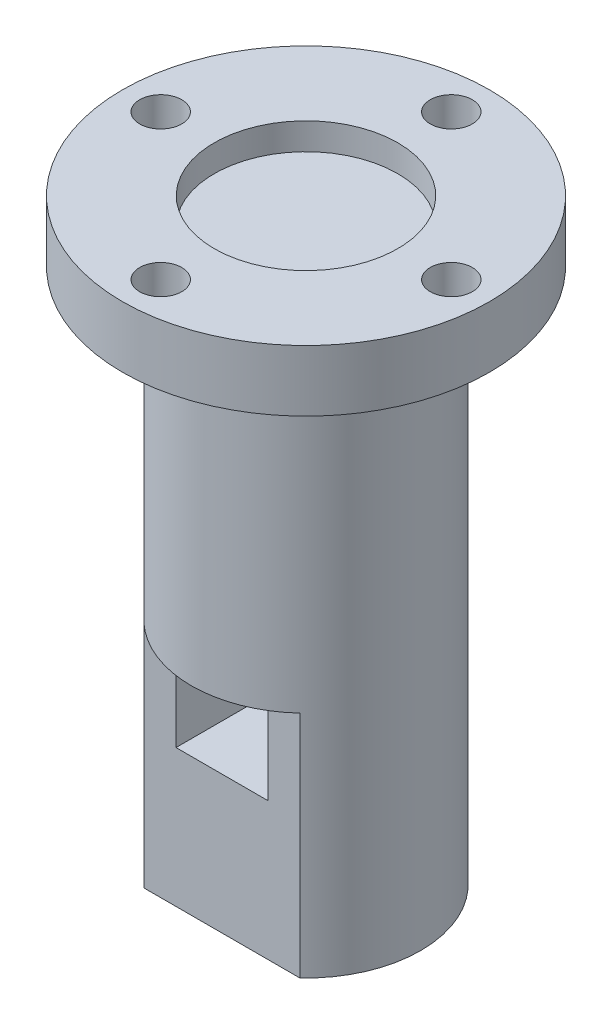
ISO-10303-21;
HEADER;
FILE_DESCRIPTION(('STEP AP214'),'2;1');
FILE_NAME('part.step','',(''),(''),'','','');
FILE_SCHEMA(('AUTOMOTIVE_DESIGN { 1 0 10303 214 1 1 1 1 }'));
ENDSEC;
DATA;
#1=APPLICATION_CONTEXT('core data for automotive mechanical design processes');
#2=APPLICATION_PROTOCOL_DEFINITION('international standard','automotive_design',2000,#1);
#3=PRODUCT_CONTEXT('',#1,'mechanical');
#4=PRODUCT('Part','Part','',(#3));
#5=PRODUCT_RELATED_PRODUCT_CATEGORY('part','',(#4));
#6=PRODUCT_DEFINITION_FORMATION('','',#4);
#7=PRODUCT_DEFINITION_CONTEXT('part definition',#1,'design');
#8=PRODUCT_DEFINITION('design','',#6,#7);
#9=PRODUCT_DEFINITION_SHAPE('','',#8);
#10=(LENGTH_UNIT() NAMED_UNIT(*) SI_UNIT(.MILLI.,.METRE.));
#11=(NAMED_UNIT(*) PLANE_ANGLE_UNIT() SI_UNIT($,.RADIAN.));
#12=(NAMED_UNIT(*) SI_UNIT($,.STERADIAN.) SOLID_ANGLE_UNIT());
#13=UNCERTAINTY_MEASURE_WITH_UNIT(LENGTH_MEASURE(1.E-05),#10,'distance_accuracy_value','');
#14=(GEOMETRIC_REPRESENTATION_CONTEXT(3) GLOBAL_UNCERTAINTY_ASSIGNED_CONTEXT((#13)) GLOBAL_UNIT_ASSIGNED_CONTEXT((#10,
#11,#12)) REPRESENTATION_CONTEXT('',''));
#15=CARTESIAN_POINT('',(0.,0.,0.));
#16=DIRECTION('',(0.,0.,1.));
#17=DIRECTION('',(1.,0.,0.));
#18=AXIS2_PLACEMENT_3D('',#15,#16,#17);
#19=CARTESIAN_POINT('',(0.,8.,0.));
#20=DIRECTION('',(0.,-1.,0.));
#21=DIRECTION('',(0.,0.,-1.));
#22=AXIS2_PLACEMENT_3D('',#19,#20,#21);
#23=CYLINDRICAL_SURFACE('',#22,24.);
#24=CARTESIAN_POINT('',(0.,8.,0.));
#25=DIRECTION('',(0.,1.,0.));
#26=DIRECTION('',(0.,0.,1.));
#27=AXIS2_PLACEMENT_3D('',#24,#25,#26);
#28=CIRCLE('',#27,24.);
#29=CARTESIAN_POINT('',(0.,8.,24.));
#30=VERTEX_POINT('',#29);
#31=EDGE_CURVE('E42',#30,#30,#28,.T.);
#32=ORIENTED_EDGE('',*,*,#31,.F.);
#33=EDGE_LOOP('',(#32));
#34=FACE_BOUND('',#33,.T.);
#35=CARTESIAN_POINT('',(0.,0.,0.));
#36=DIRECTION('',(0.,1.,0.));
#37=DIRECTION('',(0.,0.,1.));
#38=AXIS2_PLACEMENT_3D('',#35,#36,#37);
#39=CIRCLE('',#38,24.);
#40=CARTESIAN_POINT('',(0.,0.,24.));
#41=VERTEX_POINT('',#40);
#42=EDGE_CURVE('E143',#41,#41,#39,.T.);
#43=ORIENTED_EDGE('',*,*,#42,.T.);
#44=EDGE_LOOP('',(#43));
#45=FACE_BOUND('',#44,.T.);
#46=ADVANCED_FACE('F35',(#34,#45),#23,.T.);
#47=CARTESIAN_POINT('',(0.,8.,0.));
#48=DIRECTION('',(0.,1.,0.));
#49=DIRECTION('',(0.,0.,1.));
#50=AXIS2_PLACEMENT_3D('',#47,#48,#49);
#51=PLANE('',#50);
#52=CARTESIAN_POINT('',(1.99014436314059E-13,8.,-19.));
#53=DIRECTION('',(0.,1.,0.));
#54=DIRECTION('',(0.,0.,1.));
#55=AXIS2_PLACEMENT_3D('',#52,#53,#54);
#56=CIRCLE('',#55,2.75);
#57=CARTESIAN_POINT('',(1.99014436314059E-13,8.,-16.25));
#58=VERTEX_POINT('',#57);
#59=EDGE_CURVE('E386',#58,#58,#56,.T.);
#60=ORIENTED_EDGE('',*,*,#59,.F.);
#61=EDGE_LOOP('',(#60));
#62=FACE_BOUND('',#61,.T.);
#63=CARTESIAN_POINT('',(-19.,8.,-1.32676290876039E-13));
#64=DIRECTION('',(0.,1.,0.));
#65=DIRECTION('',(0.,0.,1.));
#66=AXIS2_PLACEMENT_3D('',#63,#64,#65);
#67=CIRCLE('',#66,2.75);
#68=CARTESIAN_POINT('',(-19.,8.,2.74999999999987));
#69=VERTEX_POINT('',#68);
#70=EDGE_CURVE('E380',#69,#69,#67,.T.);
#71=ORIENTED_EDGE('',*,*,#70,.F.);
#72=EDGE_LOOP('',(#71));
#73=FACE_BOUND('',#72,.T.);
#74=CARTESIAN_POINT('',(0.,8.,19.));
#75=DIRECTION('',(0.,1.,0.));
#76=DIRECTION('',(0.,0.,1.));
#77=AXIS2_PLACEMENT_3D('',#74,#75,#76);
#78=CIRCLE('',#77,2.75);
#79=CARTESIAN_POINT('',(0.,8.,21.75));
#80=VERTEX_POINT('',#79);
#81=EDGE_CURVE('E374',#80,#80,#78,.T.);
#82=ORIENTED_EDGE('',*,*,#81,.F.);
#83=EDGE_LOOP('',(#82));
#84=FACE_BOUND('',#83,.T.);
#85=CARTESIAN_POINT('',(19.,8.,0.));
#86=DIRECTION('',(0.,1.,0.));
#87=DIRECTION('',(0.,0.,1.));
#88=AXIS2_PLACEMENT_3D('',#85,#86,#87);
#89=CIRCLE('',#88,2.75);
#90=CARTESIAN_POINT('',(19.,8.,2.75));
#91=VERTEX_POINT('',#90);
#92=EDGE_CURVE('E367',#91,#91,#89,.T.);
#93=ORIENTED_EDGE('',*,*,#92,.F.);
#94=EDGE_LOOP('',(#93));
#95=FACE_BOUND('',#94,.T.);
#96=CARTESIAN_POINT('',(0.,8.,0.));
#97=DIRECTION('',(0.,1.,0.));
#98=DIRECTION('',(0.,0.,1.));
#99=AXIS2_PLACEMENT_3D('',#96,#97,#98);
#100=CIRCLE('',#99,12.);
#101=CARTESIAN_POINT('',(0.,8.,12.));
#102=VERTEX_POINT('',#101);
#103=EDGE_CURVE('E115',#102,#102,#100,.T.);
#104=ORIENTED_EDGE('',*,*,#103,.F.);
#105=EDGE_LOOP('',(#104));
#106=FACE_BOUND('',#105,.T.);
#107=ORIENTED_EDGE('',*,*,#31,.T.);
#108=EDGE_LOOP('',(#107));
#109=FACE_BOUND('',#108,.T.);
#110=ADVANCED_FACE('F152',(#62,#73,#84,#95,#106,#109),#51,.T.);
#111=CARTESIAN_POINT('',(0.,0.,0.));
#112=DIRECTION('',(0.,1.,0.));
#113=DIRECTION('',(0.,0.,1.));
#114=AXIS2_PLACEMENT_3D('',#111,#112,#113);
#115=PLANE('',#114);
#116=CARTESIAN_POINT('',(0.,0.,0.));
#117=DIRECTION('',(0.,1.,0.));
#118=DIRECTION('',(0.,0.,1.));
#119=AXIS2_PLACEMENT_3D('',#116,#117,#118);
#120=CIRCLE('',#119,15.);
#121=CARTESIAN_POINT('',(0.,0.,15.));
#122=VERTEX_POINT('',#121);
#123=EDGE_CURVE('E11',#122,#122,#120,.F.);
#124=ORIENTED_EDGE('',*,*,#123,.F.);
#125=EDGE_LOOP('',(#124));
#126=FACE_BOUND('',#125,.T.);
#127=ORIENTED_EDGE('',*,*,#42,.F.);
#128=EDGE_LOOP('',(#127));
#129=FACE_BOUND('',#128,.T.);
#130=ADVANCED_FACE('F149',(#126,#129),#115,.F.);
#131=CARTESIAN_POINT('',(0.,-70.,0.));
#132=DIRECTION('',(0.,1.,0.));
#133=DIRECTION('',(0.,0.,1.));
#134=AXIS2_PLACEMENT_3D('',#131,#132,#133);
#135=CYLINDRICAL_SURFACE('',#134,15.);
#136=CARTESIAN_POINT('',(0.,-70.,0.));
#137=DIRECTION('',(0.,-1.,0.));
#138=DIRECTION('',(0.,0.,-1.));
#139=AXIS2_PLACEMENT_3D('',#136,#137,#138);
#140=CIRCLE('',#139,15.);
#141=CARTESIAN_POINT('',(-10.1980390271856,-70.,11.));
#142=VERTEX_POINT('',#141);
#143=CARTESIAN_POINT('',(10.1980390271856,-70.,11.));
#144=VERTEX_POINT('',#143);
#145=EDGE_CURVE('E138',#142,#144,#140,.T.);
#146=ORIENTED_EDGE('',*,*,#145,.F.);
#147=DIRECTION('',(0.,-1.,0.));
#148=VECTOR('',#147,1.);
#149=CARTESIAN_POINT('',(-10.1980390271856,-40.,11.));
#150=LINE('',#149,#148);
#151=CARTESIAN_POINT('',(-10.1980390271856,-40.,11.));
#152=VERTEX_POINT('',#151);
#153=EDGE_CURVE('E57',#152,#142,#150,.T.);
#154=ORIENTED_EDGE('',*,*,#153,.F.);
#155=CARTESIAN_POINT('',(0.,-40.,0.));
#156=DIRECTION('',(0.,-1.,0.));
#157=DIRECTION('',(0.,0.,-1.));
#158=AXIS2_PLACEMENT_3D('',#155,#156,#157);
#159=CIRCLE('',#158,15.);
#160=CARTESIAN_POINT('',(10.1980390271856,-40.,11.));
#161=VERTEX_POINT('',#160);
#162=EDGE_CURVE('E132',#161,#152,#159,.T.);
#163=ORIENTED_EDGE('',*,*,#162,.F.);
#164=DIRECTION('',(0.,-1.,0.));
#165=VECTOR('',#164,1.);
#166=CARTESIAN_POINT('',(10.1980390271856,-40.,11.));
#167=LINE('',#166,#165);
#168=EDGE_CURVE('E135',#161,#144,#167,.T.);
#169=ORIENTED_EDGE('',*,*,#168,.T.);
#170=EDGE_LOOP('',(#146,#154,#163,#169));
#171=FACE_BOUND('',#170,.T.);
#172=ORIENTED_EDGE('',*,*,#123,.T.);
#173=EDGE_LOOP('',(#172));
#174=FACE_BOUND('',#173,.T.);
#175=ADVANCED_FACE('F151',(#171,#174),#135,.T.);
#176=CARTESIAN_POINT('',(0.,-70.,0.));
#177=DIRECTION('',(0.,-1.,0.));
#178=DIRECTION('',(0.,0.,-1.));
#179=AXIS2_PLACEMENT_3D('',#176,#177,#178);
#180=PLANE('',#179);
#181=DIRECTION('',(1.,0.,0.));
#182=VECTOR('',#181,1.);
#183=CARTESIAN_POINT('',(-10.1980390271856,-70.,11.));
#184=LINE('',#183,#182);
#185=EDGE_CURVE('E127',#142,#144,#184,.T.);
#186=ORIENTED_EDGE('',*,*,#185,.F.);
#187=ORIENTED_EDGE('',*,*,#145,.T.);
#188=EDGE_LOOP('',(#186,#187));
#189=FACE_BOUND('',#188,.T.);
#190=ADVANCED_FACE('F158',(#189),#180,.T.);
#191=CARTESIAN_POINT('',(-10.1980390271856,-40.,11.));
#192=DIRECTION('',(0.,0.,-1.));
#193=DIRECTION('',(-1.,0.,0.));
#194=AXIS2_PLACEMENT_3D('',#191,#192,#193);
#195=PLANE('',#194);
#196=DIRECTION('',(1.,0.,0.));
#197=VECTOR('',#196,1.);
#198=CARTESIAN_POINT('',(-10.1980390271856,-40.,11.));
#199=LINE('',#198,#197);
#200=CARTESIAN_POINT('',(6.,-40.,11.));
#201=VERTEX_POINT('',#200);
#202=EDGE_CURVE('E133',#201,#161,#199,.T.);
#203=ORIENTED_EDGE('',*,*,#202,.F.);
#204=DIRECTION('',(0.,1.,0.));
#205=VECTOR('',#204,1.);
#206=CARTESIAN_POINT('',(6.00000000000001,-52.,11.));
#207=LINE('',#206,#205);
#208=CARTESIAN_POINT('',(6.00000000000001,-52.,11.));
#209=VERTEX_POINT('',#208);
#210=EDGE_CURVE('E49',#209,#201,#207,.T.);
#211=ORIENTED_EDGE('',*,*,#210,.F.);
#212=DIRECTION('',(1.,0.,0.));
#213=VECTOR('',#212,1.);
#214=CARTESIAN_POINT('',(-5.99999999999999,-52.,11.));
#215=LINE('',#214,#213);
#216=CARTESIAN_POINT('',(-5.99999999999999,-52.,11.));
#217=VERTEX_POINT('',#216);
#218=EDGE_CURVE('E112',#217,#209,#215,.T.);
#219=ORIENTED_EDGE('',*,*,#218,.F.);
#220=DIRECTION('',(0.,-1.,0.));
#221=VECTOR('',#220,1.);
#222=CARTESIAN_POINT('',(-6.,-40.,11.));
#223=LINE('',#222,#221);
#224=CARTESIAN_POINT('',(-6.,-40.,11.));
#225=VERTEX_POINT('',#224);
#226=EDGE_CURVE('E120',#225,#217,#223,.T.);
#227=ORIENTED_EDGE('',*,*,#226,.F.);
#228=EDGE_CURVE('E94',#152,#225,#199,.T.);
#229=ORIENTED_EDGE('',*,*,#228,.F.);
#230=ORIENTED_EDGE('',*,*,#153,.T.);
#231=ORIENTED_EDGE('',*,*,#185,.T.);
#232=ORIENTED_EDGE('',*,*,#168,.F.);
#233=EDGE_LOOP('',(#203,#211,#219,#227,#229,#230,#231,#232));
#234=FACE_BOUND('',#233,.T.);
#235=ADVANCED_FACE('F286',(#234),#195,.F.);
#236=CARTESIAN_POINT('',(0.,-40.,0.));
#237=DIRECTION('',(0.,-1.,0.));
#238=DIRECTION('',(0.,0.,-1.));
#239=AXIS2_PLACEMENT_3D('',#236,#237,#238);
#240=PLANE('',#239);
#241=ORIENTED_EDGE('',*,*,#228,.T.);
#242=DIRECTION('',(0.,0.,1.));
#243=VECTOR('',#242,1.);
#244=CARTESIAN_POINT('',(-6.,-40.,-1.));
#245=LINE('',#244,#243);
#246=CARTESIAN_POINT('',(-6.,-40.,-1.));
#247=VERTEX_POINT('',#246);
#248=EDGE_CURVE('E87',#247,#225,#245,.T.);
#249=ORIENTED_EDGE('',*,*,#248,.F.);
#250=DIRECTION('',(-1.,0.,0.));
#251=VECTOR('',#250,1.);
#252=CARTESIAN_POINT('',(6.,-40.,-1.));
#253=LINE('',#252,#251);
#254=CARTESIAN_POINT('',(6.,-40.,-1.));
#255=VERTEX_POINT('',#254);
#256=EDGE_CURVE('E91',#255,#247,#253,.T.);
#257=ORIENTED_EDGE('',*,*,#256,.F.);
#258=DIRECTION('',(0.,0.,1.));
#259=VECTOR('',#258,1.);
#260=CARTESIAN_POINT('',(6.,-40.,-1.));
#261=LINE('',#260,#259);
#262=EDGE_CURVE('E125',#255,#201,#261,.T.);
#263=ORIENTED_EDGE('',*,*,#262,.T.);
#264=ORIENTED_EDGE('',*,*,#202,.T.);
#265=ORIENTED_EDGE('',*,*,#162,.T.);
#266=EDGE_LOOP('',(#241,#249,#257,#263,#264,#265));
#267=FACE_BOUND('',#266,.T.);
#268=ADVANCED_FACE('F89',(#267),#240,.T.);
#269=CARTESIAN_POINT('',(6.00000000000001,-52.,-1.));
#270=DIRECTION('',(1.,0.,0.));
#271=DIRECTION('',(0.,1.,0.));
#272=AXIS2_PLACEMENT_3D('',#269,#270,#271);
#273=PLANE('',#272);
#274=ORIENTED_EDGE('',*,*,#210,.T.);
#275=ORIENTED_EDGE('',*,*,#262,.F.);
#276=DIRECTION('',(0.,1.,0.));
#277=VECTOR('',#276,1.);
#278=CARTESIAN_POINT('',(6.00000000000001,-52.,-1.));
#279=LINE('',#278,#277);
#280=CARTESIAN_POINT('',(6.00000000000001,-52.,-1.));
#281=VERTEX_POINT('',#280);
#282=EDGE_CURVE('E99',#281,#255,#279,.T.);
#283=ORIENTED_EDGE('',*,*,#282,.F.);
#284=DIRECTION('',(0.,0.,1.));
#285=VECTOR('',#284,1.);
#286=CARTESIAN_POINT('',(6.00000000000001,-52.,-1.));
#287=LINE('',#286,#285);
#288=EDGE_CURVE('E128',#281,#209,#287,.T.);
#289=ORIENTED_EDGE('',*,*,#288,.T.);
#290=EDGE_LOOP('',(#274,#275,#283,#289));
#291=FACE_BOUND('',#290,.T.);
#292=ADVANCED_FACE('F275',(#291),#273,.F.);
#293=CARTESIAN_POINT('',(-5.99999999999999,-52.,-1.));
#294=DIRECTION('',(0.,-1.,0.));
#295=DIRECTION('',(0.,0.,-1.));
#296=AXIS2_PLACEMENT_3D('',#293,#294,#295);
#297=PLANE('',#296);
#298=ORIENTED_EDGE('',*,*,#218,.T.);
#299=ORIENTED_EDGE('',*,*,#288,.F.);
#300=DIRECTION('',(1.,0.,0.));
#301=VECTOR('',#300,1.);
#302=CARTESIAN_POINT('',(-5.99999999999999,-52.,-1.));
#303=LINE('',#302,#301);
#304=CARTESIAN_POINT('',(-5.99999999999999,-52.,-1.));
#305=VERTEX_POINT('',#304);
#306=EDGE_CURVE('E107',#305,#281,#303,.T.);
#307=ORIENTED_EDGE('',*,*,#306,.F.);
#308=DIRECTION('',(0.,0.,1.));
#309=VECTOR('',#308,1.);
#310=CARTESIAN_POINT('',(-5.99999999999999,-52.,-1.));
#311=LINE('',#310,#309);
#312=EDGE_CURVE('E98',#305,#217,#311,.T.);
#313=ORIENTED_EDGE('',*,*,#312,.T.);
#314=EDGE_LOOP('',(#298,#299,#307,#313));
#315=FACE_BOUND('',#314,.T.);
#316=ADVANCED_FACE('F278',(#315),#297,.F.);
#317=CARTESIAN_POINT('',(-6.,-40.,-1.));
#318=DIRECTION('',(-1.,0.,0.));
#319=DIRECTION('',(0.,-1.,0.));
#320=AXIS2_PLACEMENT_3D('',#317,#318,#319);
#321=PLANE('',#320);
#322=ORIENTED_EDGE('',*,*,#226,.T.);
#323=ORIENTED_EDGE('',*,*,#312,.F.);
#324=DIRECTION('',(0.,-1.,0.));
#325=VECTOR('',#324,1.);
#326=CARTESIAN_POINT('',(-6.,-40.,-1.));
#327=LINE('',#326,#325);
#328=EDGE_CURVE('E102',#247,#305,#327,.T.);
#329=ORIENTED_EDGE('',*,*,#328,.F.);
#330=ORIENTED_EDGE('',*,*,#248,.T.);
#331=EDGE_LOOP('',(#322,#323,#329,#330));
#332=FACE_BOUND('',#331,.T.);
#333=ADVANCED_FACE('F103',(#332),#321,.F.);
#334=CARTESIAN_POINT('',(0.,0.,-1.));
#335=DIRECTION('',(0.,0.,1.));
#336=DIRECTION('',(1.,0.,0.));
#337=AXIS2_PLACEMENT_3D('',#334,#335,#336);
#338=PLANE('',#337);
#339=ORIENTED_EDGE('',*,*,#256,.T.);
#340=ORIENTED_EDGE('',*,*,#328,.T.);
#341=ORIENTED_EDGE('',*,*,#306,.T.);
#342=ORIENTED_EDGE('',*,*,#282,.T.);
#343=EDGE_LOOP('',(#339,#340,#341,#342));
#344=FACE_BOUND('',#343,.T.);
#345=ADVANCED_FACE('F109',(#344),#338,.T.);
#346=CARTESIAN_POINT('',(0.,4.5,0.));
#347=DIRECTION('',(0.,1.,0.));
#348=DIRECTION('',(0.,0.,1.));
#349=AXIS2_PLACEMENT_3D('',#346,#347,#348);
#350=CYLINDRICAL_SURFACE('',#349,12.);
#351=CARTESIAN_POINT('',(0.,4.5,0.));
#352=DIRECTION('',(0.,1.,0.));
#353=DIRECTION('',(0.,0.,1.));
#354=AXIS2_PLACEMENT_3D('',#351,#352,#353);
#355=CIRCLE('',#354,12.);
#356=CARTESIAN_POINT('',(0.,4.5,12.));
#357=VERTEX_POINT('',#356);
#358=EDGE_CURVE('E122',#357,#357,#355,.T.);
#359=ORIENTED_EDGE('',*,*,#358,.F.);
#360=EDGE_LOOP('',(#359));
#361=FACE_BOUND('',#360,.T.);
#362=ORIENTED_EDGE('',*,*,#103,.T.);
#363=EDGE_LOOP('',(#362));
#364=FACE_BOUND('',#363,.T.);
#365=ADVANCED_FACE('F268',(#361,#364),#350,.F.);
#366=CARTESIAN_POINT('',(0.,4.5,0.));
#367=DIRECTION('',(0.,1.,0.));
#368=DIRECTION('',(0.,0.,1.));
#369=AXIS2_PLACEMENT_3D('',#366,#367,#368);
#370=PLANE('',#369);
#371=ORIENTED_EDGE('',*,*,#358,.T.);
#372=EDGE_LOOP('',(#371));
#373=FACE_BOUND('',#372,.T.);
#374=ADVANCED_FACE('F181',(#373),#370,.T.);
#375=CARTESIAN_POINT('',(19.,2.5,0.));
#376=DIRECTION('',(0.,1.,0.));
#377=DIRECTION('',(0.,0.,1.));
#378=AXIS2_PLACEMENT_3D('',#375,#376,#377);
#379=CYLINDRICAL_SURFACE('',#378,2.75);
#380=CARTESIAN_POINT('',(19.,2.5,0.));
#381=DIRECTION('',(0.,1.,0.));
#382=DIRECTION('',(0.,0.,1.));
#383=AXIS2_PLACEMENT_3D('',#380,#381,#382);
#384=CIRCLE('',#383,2.75);
#385=CARTESIAN_POINT('',(19.,2.5,2.75));
#386=VERTEX_POINT('',#385);
#387=EDGE_CURVE('E365',#386,#386,#384,.T.);
#388=ORIENTED_EDGE('',*,*,#387,.F.);
#389=EDGE_LOOP('',(#388));
#390=FACE_BOUND('',#389,.T.);
#391=ORIENTED_EDGE('',*,*,#92,.T.);
#392=EDGE_LOOP('',(#391));
#393=FACE_BOUND('',#392,.T.);
#394=ADVANCED_FACE('F186',(#390,#393),#379,.F.);
#395=CARTESIAN_POINT('',(19.,2.5,0.));
#396=DIRECTION('',(0.,1.,0.));
#397=DIRECTION('',(0.,0.,1.));
#398=AXIS2_PLACEMENT_3D('',#395,#396,#397);
#399=PLANE('',#398);
#400=ORIENTED_EDGE('',*,*,#387,.T.);
#401=EDGE_LOOP('',(#400));
#402=FACE_BOUND('',#401,.T.);
#403=ADVANCED_FACE('F191',(#402),#399,.T.);
#404=CARTESIAN_POINT('',(0.,2.5,19.));
#405=DIRECTION('',(0.,1.,0.));
#406=DIRECTION('',(0.,0.,1.));
#407=AXIS2_PLACEMENT_3D('',#404,#405,#406);
#408=CYLINDRICAL_SURFACE('',#407,2.75);
#409=CARTESIAN_POINT('',(0.,2.5,19.));
#410=DIRECTION('',(0.,1.,0.));
#411=DIRECTION('',(0.,0.,1.));
#412=AXIS2_PLACEMENT_3D('',#409,#410,#411);
#413=CIRCLE('',#412,2.75);
#414=CARTESIAN_POINT('',(0.,2.5,21.75));
#415=VERTEX_POINT('',#414);
#416=EDGE_CURVE('E371',#415,#415,#413,.T.);
#417=ORIENTED_EDGE('',*,*,#416,.F.);
#418=EDGE_LOOP('',(#417));
#419=FACE_BOUND('',#418,.T.);
#420=ORIENTED_EDGE('',*,*,#81,.T.);
#421=EDGE_LOOP('',(#420));
#422=FACE_BOUND('',#421,.T.);
#423=ADVANCED_FACE('F201',(#419,#422),#408,.F.);
#424=CARTESIAN_POINT('',(0.,2.5,19.));
#425=DIRECTION('',(0.,1.,0.));
#426=DIRECTION('',(0.,0.,1.));
#427=AXIS2_PLACEMENT_3D('',#424,#425,#426);
#428=PLANE('',#427);
#429=ORIENTED_EDGE('',*,*,#416,.T.);
#430=EDGE_LOOP('',(#429));
#431=FACE_BOUND('',#430,.T.);
#432=ADVANCED_FACE('F211',(#431),#428,.T.);
#433=CARTESIAN_POINT('',(-19.,2.5,-1.32676290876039E-13));
#434=DIRECTION('',(0.,1.,0.));
#435=DIRECTION('',(0.,0.,1.));
#436=AXIS2_PLACEMENT_3D('',#433,#434,#435);
#437=CYLINDRICAL_SURFACE('',#436,2.75);
#438=CARTESIAN_POINT('',(-19.,2.5,-1.32676290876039E-13));
#439=DIRECTION('',(0.,1.,0.));
#440=DIRECTION('',(0.,0.,1.));
#441=AXIS2_PLACEMENT_3D('',#438,#439,#440);
#442=CIRCLE('',#441,2.75);
#443=CARTESIAN_POINT('',(-19.,2.5,2.74999999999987));
#444=VERTEX_POINT('',#443);
#445=EDGE_CURVE('E377',#444,#444,#442,.T.);
#446=ORIENTED_EDGE('',*,*,#445,.F.);
#447=EDGE_LOOP('',(#446));
#448=FACE_BOUND('',#447,.T.);
#449=ORIENTED_EDGE('',*,*,#70,.T.);
#450=EDGE_LOOP('',(#449));
#451=FACE_BOUND('',#450,.T.);
#452=ADVANCED_FACE('F221',(#448,#451),#437,.F.);
#453=CARTESIAN_POINT('',(-19.,2.5,-1.32676290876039E-13));
#454=DIRECTION('',(0.,1.,0.));
#455=DIRECTION('',(0.,0.,1.));
#456=AXIS2_PLACEMENT_3D('',#453,#454,#455);
#457=PLANE('',#456);
#458=ORIENTED_EDGE('',*,*,#445,.T.);
#459=EDGE_LOOP('',(#458));
#460=FACE_BOUND('',#459,.T.);
#461=ADVANCED_FACE('F231',(#460),#457,.T.);
#462=CARTESIAN_POINT('',(1.99014436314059E-13,2.5,-19.));
#463=DIRECTION('',(0.,1.,0.));
#464=DIRECTION('',(0.,0.,1.));
#465=AXIS2_PLACEMENT_3D('',#462,#463,#464);
#466=CYLINDRICAL_SURFACE('',#465,2.75);
#467=CARTESIAN_POINT('',(1.99014436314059E-13,2.5,-19.));
#468=DIRECTION('',(0.,1.,0.));
#469=DIRECTION('',(0.,0.,1.));
#470=AXIS2_PLACEMENT_3D('',#467,#468,#469);
#471=CIRCLE('',#470,2.75);
#472=CARTESIAN_POINT('',(1.99014436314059E-13,2.5,-16.25));
#473=VERTEX_POINT('',#472);
#474=EDGE_CURVE('E383',#473,#473,#471,.T.);
#475=ORIENTED_EDGE('',*,*,#474,.F.);
#476=EDGE_LOOP('',(#475));
#477=FACE_BOUND('',#476,.T.);
#478=ORIENTED_EDGE('',*,*,#59,.T.);
#479=EDGE_LOOP('',(#478));
#480=FACE_BOUND('',#479,.T.);
#481=ADVANCED_FACE('F241',(#477,#480),#466,.F.);
#482=CARTESIAN_POINT('',(1.99014436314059E-13,2.5,-19.));
#483=DIRECTION('',(0.,1.,0.));
#484=DIRECTION('',(0.,0.,1.));
#485=AXIS2_PLACEMENT_3D('',#482,#483,#484);
#486=PLANE('',#485);
#487=ORIENTED_EDGE('',*,*,#474,.T.);
#488=EDGE_LOOP('',(#487));
#489=FACE_BOUND('',#488,.T.);
#490=ADVANCED_FACE('F251',(#489),#486,.T.);
#491=CLOSED_SHELL('',(#46,#110,#130,#175,#190,#235,#268,#292,#316,#333,#345,#365,#374,#394,#403,
#423,#432,#452,#461,#481,#490));
#492=MANIFOLD_SOLID_BREP('B2',#491);
#493=ADVANCED_BREP_SHAPE_REPRESENTATION('',(#18,#492),#14);
#494=SHAPE_DEFINITION_REPRESENTATION(#9,#493);
ENDSEC;
END-ISO-10303-21;
